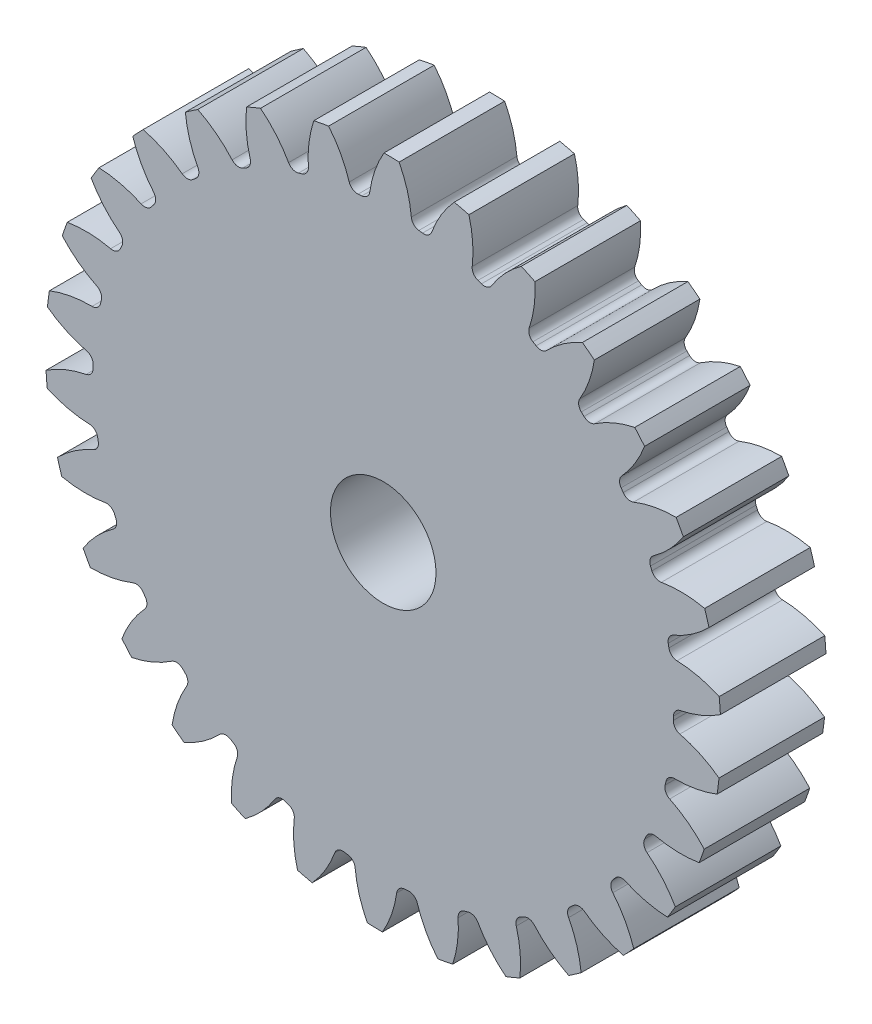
from build123d import *

# Parameters (mm, degrees)
SKETCH3_R         = 325.12
GEARBODY_DEPTH    = 101.6
TOOTHCUT_DEPTH    = 471.880652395
CIRPATTERN1_COUNT = 30
BOREDIA_R         = 50.8
BORE_DEPTH        = 12700


with BuildPart() as part:
    # Sketch3 → gearBody (new body)
    with BuildSketch(Plane.XY):
        Circle(SKETCH3_R)
    extrude(amount=GEARBODY_DEPTH)

    # Sketch2 → toothCut (cut, through all)
    with BuildSketch(Plane.XY):
        with BuildLine():
            ThreePointArc((279.26491054, -8.687332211), (279.315031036, -6.89009706), (279.353585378, -5.092576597))
            ThreePointArc((279.353585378, -5.092576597), (281.273973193, 0.057031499), (285.998062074, 2.865827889))
            ThreePointArc((285.998062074, 2.865827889), (306.356627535, 9.065477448), (325.12, 19.107523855))
            ThreePointArc((325.12, 19.107523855), (325.581953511, -8.031401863), (323.78245902, -35.114542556))
            ThreePointArc((323.78245902, -35.114542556), (305.537037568, -24.159569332), (285.508911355, -16.963667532))
            ThreePointArc((285.508911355, -16.963667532), (280.929057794, -13.925363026), (279.26491054, -8.687332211))
        make_face()
    toothcut = extrude(amount=TOOTHCUT_DEPTH, mode=Mode.SUBTRACT)

    # CirPattern1: toothCut ×30 about axis
    cirpattern1_axis = Axis((0, 0, 0), (0, 0, 1))
    for i in range(1, CIRPATTERN1_COUNT):
        add(toothcut.rotate(cirpattern1_axis, i * 360 / CIRPATTERN1_COUNT), mode=Mode.SUBTRACT)

    # boreDia → bore (cut, symmetric)
    with BuildSketch(Plane.XY):
        Circle(BOREDIA_R)
    extrude(amount=BORE_DEPTH, both=True, mode=Mode.SUBTRACT)


solid = part.part
